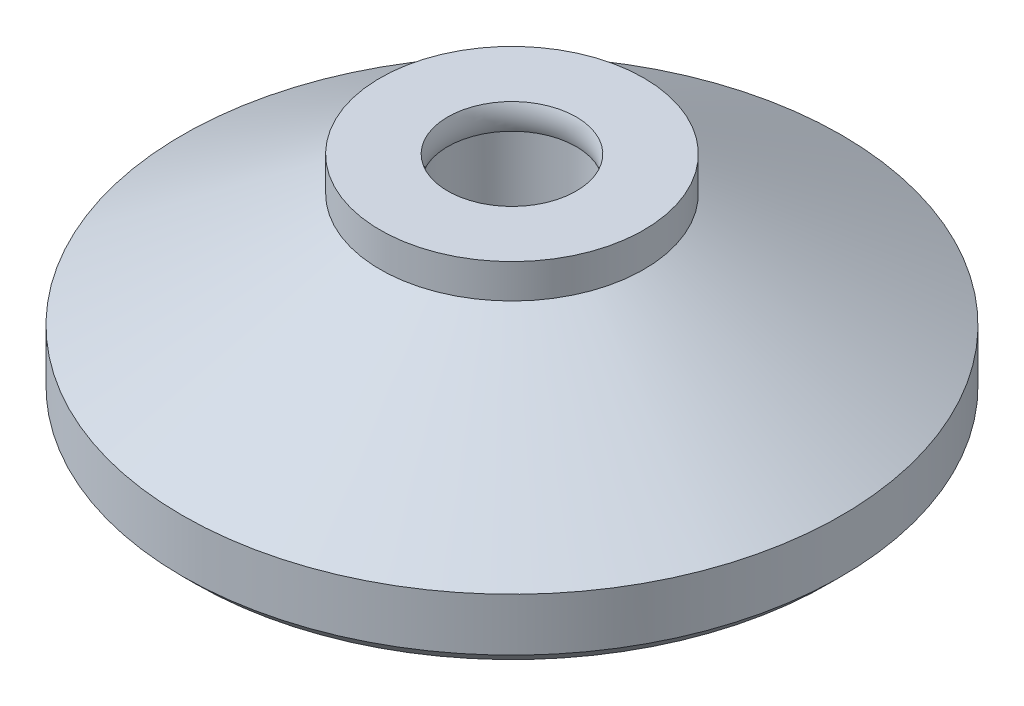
ISO-10303-21;
HEADER;
FILE_DESCRIPTION(('STEP AP214'),'2;1');
FILE_NAME('part.step','',(''),(''),'','','');
FILE_SCHEMA(('AUTOMOTIVE_DESIGN { 1 0 10303 214 1 1 1 1 }'));
ENDSEC;
DATA;
#1=APPLICATION_CONTEXT('core data for automotive mechanical design processes');
#2=APPLICATION_PROTOCOL_DEFINITION('international standard','automotive_design',2000,#1);
#3=PRODUCT_CONTEXT('',#1,'mechanical');
#4=PRODUCT('Part','Part','',(#3));
#5=PRODUCT_RELATED_PRODUCT_CATEGORY('part','',(#4));
#6=PRODUCT_DEFINITION_FORMATION('','',#4);
#7=PRODUCT_DEFINITION_CONTEXT('part definition',#1,'design');
#8=PRODUCT_DEFINITION('design','',#6,#7);
#9=PRODUCT_DEFINITION_SHAPE('','',#8);
#10=(LENGTH_UNIT() NAMED_UNIT(*) SI_UNIT(.MILLI.,.METRE.));
#11=(NAMED_UNIT(*) PLANE_ANGLE_UNIT() SI_UNIT($,.RADIAN.));
#12=(NAMED_UNIT(*) SI_UNIT($,.STERADIAN.) SOLID_ANGLE_UNIT());
#13=UNCERTAINTY_MEASURE_WITH_UNIT(LENGTH_MEASURE(1.E-05),#10,'distance_accuracy_value','');
#14=(GEOMETRIC_REPRESENTATION_CONTEXT(3) GLOBAL_UNCERTAINTY_ASSIGNED_CONTEXT((#13)) GLOBAL_UNIT_ASSIGNED_CONTEXT((#10,
#11,#12)) REPRESENTATION_CONTEXT('',''));
#15=CARTESIAN_POINT('',(0.,0.,0.));
#16=DIRECTION('',(0.,0.,1.));
#17=DIRECTION('',(1.,0.,0.));
#18=AXIS2_PLACEMENT_3D('',#15,#16,#17);
#19=CARTESIAN_POINT('',(0.,6.5,0.));
#20=DIRECTION('',(0.,-1.,0.));
#21=DIRECTION('',(0.,0.,-1.));
#22=AXIS2_PLACEMENT_3D('',#19,#20,#21);
#23=CYLINDRICAL_SURFACE('',#22,8.);
#24=CARTESIAN_POINT('',(0.,4.42820323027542,0.));
#25=DIRECTION('',(0.,1.,0.));
#26=DIRECTION('',(0.,0.,1.));
#27=AXIS2_PLACEMENT_3D('',#24,#25,#26);
#28=CIRCLE('',#27,8.);
#29=CARTESIAN_POINT('',(0.,4.42820323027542,-8.));
#30=VERTEX_POINT('',#29);
#31=EDGE_CURVE('E91',#30,#30,#28,.T.);
#32=CARTESIAN_POINT('',(0.,6.5,0.));
#33=DIRECTION('',(0.,1.,0.));
#34=DIRECTION('',(0.,0.,1.));
#35=AXIS2_PLACEMENT_3D('',#32,#33,#34);
#36=CIRCLE('',#35,8.);
#37=CARTESIAN_POINT('',(0.,6.5,-8.));
#38=VERTEX_POINT('',#37);
#39=EDGE_CURVE('E93',#38,#38,#36,.T.);
#40=CARTESIAN_POINT('',(0.,4.42820323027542,-8.));
#41=CARTESIAN_POINT('',(0.,4.44978444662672,-8.));
#42=CARTESIAN_POINT('',(0.,4.47136566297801,-8.));
#43=CARTESIAN_POINT('',(0.,4.51452809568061,-8.));
#44=CARTESIAN_POINT('',(0.,4.53610931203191,-8.));
#45=CARTESIAN_POINT('',(0.,4.5792717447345,-8.));
#46=CARTESIAN_POINT('',(0.,4.6008529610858,-8.));
#47=CARTESIAN_POINT('',(0.,4.6440153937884,-8.));
#48=CARTESIAN_POINT('',(0.,4.66559661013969,-8.));
#49=CARTESIAN_POINT('',(0.,4.70875904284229,-8.));
#50=CARTESIAN_POINT('',(0.,4.73034025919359,-8.));
#51=CARTESIAN_POINT('',(0.,4.77350269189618,-8.));
#52=CARTESIAN_POINT('',(0.,4.79508390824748,-8.));
#53=CARTESIAN_POINT('',(0.,4.83824634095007,-8.));
#54=CARTESIAN_POINT('',(0.,4.85982755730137,-8.));
#55=CARTESIAN_POINT('',(0.,4.90298999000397,-8.));
#56=CARTESIAN_POINT('',(0.,4.92457120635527,-8.));
#57=CARTESIAN_POINT('',(0.,4.96773363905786,-8.));
#58=CARTESIAN_POINT('',(0.,4.98931485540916,-8.));
#59=CARTESIAN_POINT('',(0.,5.03247728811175,-8.));
#60=CARTESIAN_POINT('',(0.,5.05405850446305,-8.));
#61=CARTESIAN_POINT('',(0.,5.09722093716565,-8.));
#62=CARTESIAN_POINT('',(0.,5.11880215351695,-8.));
#63=CARTESIAN_POINT('',(0.,5.16196458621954,-8.));
#64=CARTESIAN_POINT('',(0.,5.18354580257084,-8.));
#65=CARTESIAN_POINT('',(0.,5.22670823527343,-8.));
#66=CARTESIAN_POINT('',(0.,5.24828945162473,-8.));
#67=CARTESIAN_POINT('',(0.,5.29145188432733,-8.));
#68=CARTESIAN_POINT('',(0.,5.31303310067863,-8.));
#69=CARTESIAN_POINT('',(0.,5.35619553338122,-8.));
#70=CARTESIAN_POINT('',(0.,5.37777674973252,-8.));
#71=CARTESIAN_POINT('',(0.,5.42093918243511,-8.));
#72=CARTESIAN_POINT('',(0.,5.44252039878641,-8.));
#73=CARTESIAN_POINT('',(0.,5.48568283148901,-8.));
#74=CARTESIAN_POINT('',(0.,5.5072640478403,-8.));
#75=CARTESIAN_POINT('',(0.,5.5504264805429,-8.));
#76=CARTESIAN_POINT('',(0.,5.5720076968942,-8.));
#77=CARTESIAN_POINT('',(0.,5.61517012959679,-8.));
#78=CARTESIAN_POINT('',(0.,5.63675134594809,-8.));
#79=CARTESIAN_POINT('',(0.,5.67991377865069,-8.));
#80=CARTESIAN_POINT('',(0.,5.70149499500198,-8.));
#81=CARTESIAN_POINT('',(0.,5.74465742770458,-8.));
#82=CARTESIAN_POINT('',(0.,5.76623864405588,-8.));
#83=CARTESIAN_POINT('',(0.,5.80940107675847,-8.));
#84=CARTESIAN_POINT('',(0.,5.83098229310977,-8.));
#85=CARTESIAN_POINT('',(0.,5.87414472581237,-8.));
#86=CARTESIAN_POINT('',(0.,5.89572594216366,-8.));
#87=CARTESIAN_POINT('',(0.,5.93888837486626,-8.));
#88=CARTESIAN_POINT('',(0.,5.96046959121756,-8.));
#89=CARTESIAN_POINT('',(0.,6.00363202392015,-8.));
#90=CARTESIAN_POINT('',(0.,6.02521324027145,-8.));
#91=CARTESIAN_POINT('',(0.,6.06837567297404,-8.));
#92=CARTESIAN_POINT('',(0.,6.08995688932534,-8.));
#93=CARTESIAN_POINT('',(0.,6.13311932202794,-8.));
#94=CARTESIAN_POINT('',(0.,6.15470053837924,-8.));
#95=CARTESIAN_POINT('',(0.,6.19786297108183,-8.));
#96=CARTESIAN_POINT('',(0.,6.21944418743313,-8.));
#97=CARTESIAN_POINT('',(0.,6.26260662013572,-8.));
#98=CARTESIAN_POINT('',(0.,6.28418783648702,-8.));
#99=CARTESIAN_POINT('',(0.,6.32735026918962,-8.));
#100=CARTESIAN_POINT('',(0.,6.34893148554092,-8.));
#101=CARTESIAN_POINT('',(0.,6.39209391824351,-8.));
#102=CARTESIAN_POINT('',(0.,6.41367513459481,-8.));
#103=CARTESIAN_POINT('',(0.,6.4568375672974,-8.));
#104=CARTESIAN_POINT('',(0.,6.4784187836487,-8.));
#105=CARTESIAN_POINT('',(0.,6.5,-8.));
#106=B_SPLINE_CURVE_WITH_KNOTS('',3,(#40,#41,#42,#43,#44,#45,#46,#47,#48,#49,#50,#51,#52,#53,
#54,#55,#56,#57,#58,#59,#60,#61,#62,#63,#64,#65,#66,#67,#68,#69,#70,#71,#72,#73,#74,#75,#76,#77,
#78,#79,#80,#81,#82,#83,#84,#85,#86,#87,#88,#89,#90,#91,#92,#93,#94,#95,#96,#97,#98,#99,#100,
#101,#102,#103,#104,#105),.UNSPECIFIED.,.F.,.F.,(4,2,2,2,2,2,2,2,2,2,2,2,2,2,2,2,2,2,2,2,2,2,2,
2,2,2,2,2,2,2,2,2,4),(0.,0.064743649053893,0.129487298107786,0.194230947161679,
0.258974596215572,0.323718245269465,0.388461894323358,0.453205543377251,0.517949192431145,
0.582692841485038,0.647436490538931,0.712180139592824,0.776923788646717,0.841667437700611,
0.906411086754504,0.971154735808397,1.03589838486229,1.10064203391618,1.16538568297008,
1.23012933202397,1.29487298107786,1.35961663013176,1.42436027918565,1.48910392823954,
1.55384757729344,1.61859122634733,1.68333487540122,1.74807852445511,1.81282217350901,
1.8775658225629,1.94230947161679,2.00705312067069,2.07179676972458),.UNSPECIFIED.);
#107=EDGE_CURVE('BSEAM37',#30,#38,#106,.T.);
#108=ORIENTED_EDGE('',*,*,#31,.T.);
#109=ORIENTED_EDGE('',*,*,#39,.F.);
#110=ORIENTED_EDGE('',*,*,#107,.T.);
#111=ORIENTED_EDGE('',*,*,#107,.F.);
#112=EDGE_LOOP('',(#108,#110,#109,#111));
#113=FACE_BOUND('',#112,.T.);
#114=ADVANCED_FACE('F37',(#113),#23,.T.);
#115=CARTESIAN_POINT('',(0.,6.5,0.));
#116=DIRECTION('',(0.,1.,0.));
#117=DIRECTION('',(0.,0.,1.));
#118=AXIS2_PLACEMENT_3D('',#115,#116,#117);
#119=PLANE('',#118);
#120=CARTESIAN_POINT('',(0.,6.5,0.));
#121=DIRECTION('',(0.,-1.,0.));
#122=DIRECTION('',(0.,0.,-1.));
#123=AXIS2_PLACEMENT_3D('',#120,#121,#122);
#124=CIRCLE('',#123,3.9);
#125=CARTESIAN_POINT('',(0.,6.5,-3.9));
#126=VERTEX_POINT('',#125);
#127=EDGE_CURVE('E112',#126,#126,#124,.T.);
#128=ORIENTED_EDGE('',*,*,#127,.T.);
#129=EDGE_LOOP('',(#128));
#130=FACE_BOUND('',#129,.T.);
#131=ORIENTED_EDGE('',*,*,#39,.T.);
#132=EDGE_LOOP('',(#131));
#133=FACE_BOUND('',#132,.T.);
#134=ADVANCED_FACE('F65',(#130,#133),#119,.T.);
#135=CARTESIAN_POINT('',(0.,4.42820323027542,0.));
#136=DIRECTION('',(0.,-1.,0.));
#137=DIRECTION('',(0.,0.,-1.));
#138=AXIS2_PLACEMENT_3D('',#135,#136,#137);
#139=CONICAL_SURFACE('',#138,8.,1.0471975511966);
#140=CARTESIAN_POINT('',(0.,-2.5,0.));
#141=DIRECTION('',(0.,1.,0.));
#142=DIRECTION('',(0.,0.,1.));
#143=AXIS2_PLACEMENT_3D('',#140,#141,#142);
#144=CIRCLE('',#143,20.);
#145=CARTESIAN_POINT('',(0.,-2.5,20.));
#146=VERTEX_POINT('',#145);
#147=EDGE_CURVE('E89',#146,#146,#144,.T.);
#148=ORIENTED_EDGE('',*,*,#147,.T.);
#149=EDGE_LOOP('',(#148));
#150=FACE_BOUND('',#149,.T.);
#151=ORIENTED_EDGE('',*,*,#31,.F.);
#152=EDGE_LOOP('',(#151));
#153=FACE_BOUND('',#152,.T.);
#154=ADVANCED_FACE('F70',(#150,#153),#139,.T.);
#155=CARTESIAN_POINT('',(0.,-6.5,0.));
#156=DIRECTION('',(0.,1.,0.));
#157=DIRECTION('',(0.,0.,1.));
#158=AXIS2_PLACEMENT_3D('',#155,#156,#157);
#159=PLANE('',#158);
#160=CARTESIAN_POINT('',(0.,-6.5,0.));
#161=DIRECTION('',(0.,1.,0.));
#162=DIRECTION('',(0.,0.,1.));
#163=AXIS2_PLACEMENT_3D('',#160,#161,#162);
#164=CIRCLE('',#163,19.2);
#165=CARTESIAN_POINT('',(0.,-6.5,19.2));
#166=VERTEX_POINT('',#165);
#167=EDGE_CURVE('E45',#166,#166,#164,.F.);
#168=ORIENTED_EDGE('',*,*,#167,.T.);
#169=EDGE_LOOP('',(#168));
#170=FACE_BOUND('',#169,.T.);
#171=ADVANCED_FACE('F76',(#170),#159,.F.);
#172=CARTESIAN_POINT('',(0.,-2.5,0.));
#173=DIRECTION('',(0.,-1.,0.));
#174=DIRECTION('',(0.,0.,-1.));
#175=AXIS2_PLACEMENT_3D('',#172,#173,#174);
#176=CYLINDRICAL_SURFACE('',#175,20.);
#177=CARTESIAN_POINT('',(0.,-5.69999999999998,0.));
#178=DIRECTION('',(0.,1.,0.));
#179=DIRECTION('',(0.,0.,1.));
#180=AXIS2_PLACEMENT_3D('',#177,#178,#179);
#181=CIRCLE('',#180,20.);
#182=CARTESIAN_POINT('',(0.,-5.69999999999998,20.));
#183=VERTEX_POINT('',#182);
#184=EDGE_CURVE('E11',#183,#183,#181,.T.);
#185=ORIENTED_EDGE('',*,*,#184,.T.);
#186=EDGE_LOOP('',(#185));
#187=FACE_BOUND('',#186,.T.);
#188=ORIENTED_EDGE('',*,*,#147,.F.);
#189=EDGE_LOOP('',(#188));
#190=FACE_BOUND('',#189,.T.);
#191=ADVANCED_FACE('F60',(#187,#190),#176,.T.);
#192=CARTESIAN_POINT('',(0.,-6.5,0.));
#193=DIRECTION('',(0.,1.,0.));
#194=DIRECTION('',(0.,0.,1.));
#195=AXIS2_PLACEMENT_3D('',#192,#193,#194);
#196=CONICAL_SURFACE('',#195,19.2,0.78539816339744);
#197=CARTESIAN_POINT('',(0.,-5.69999999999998,20.));
#198=CARTESIAN_POINT('',(0.,-5.70833333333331,19.9916666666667));
#199=CARTESIAN_POINT('',(0.,-5.71666666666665,19.9833333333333));
#200=CARTESIAN_POINT('',(0.,-5.73333333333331,19.9666666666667));
#201=CARTESIAN_POINT('',(0.,-5.74166666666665,19.9583333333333));
#202=CARTESIAN_POINT('',(0.,-5.75833333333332,19.9416666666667));
#203=CARTESIAN_POINT('',(0.,-5.76666666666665,19.9333333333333));
#204=CARTESIAN_POINT('',(0.,-5.78333333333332,19.9166666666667));
#205=CARTESIAN_POINT('',(0.,-5.79166666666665,19.9083333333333));
#206=CARTESIAN_POINT('',(0.,-5.80833333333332,19.8916666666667));
#207=CARTESIAN_POINT('',(0.,-5.81666666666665,19.8833333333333));
#208=CARTESIAN_POINT('',(0.,-5.83333333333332,19.8666666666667));
#209=CARTESIAN_POINT('',(0.,-5.84166666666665,19.8583333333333));
#210=CARTESIAN_POINT('',(0.,-5.85833333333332,19.8416666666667));
#211=CARTESIAN_POINT('',(0.,-5.86666666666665,19.8333333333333));
#212=CARTESIAN_POINT('',(0.,-5.88333333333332,19.8166666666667));
#213=CARTESIAN_POINT('',(0.,-5.89166666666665,19.8083333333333));
#214=CARTESIAN_POINT('',(0.,-5.90833333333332,19.7916666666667));
#215=CARTESIAN_POINT('',(0.,-5.91666666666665,19.7833333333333));
#216=CARTESIAN_POINT('',(0.,-5.93333333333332,19.7666666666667));
#217=CARTESIAN_POINT('',(0.,-5.94166666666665,19.7583333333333));
#218=CARTESIAN_POINT('',(0.,-5.95833333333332,19.7416666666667));
#219=CARTESIAN_POINT('',(0.,-5.96666666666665,19.7333333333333));
#220=CARTESIAN_POINT('',(0.,-5.98333333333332,19.7166666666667));
#221=CARTESIAN_POINT('',(0.,-5.99166666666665,19.7083333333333));
#222=CARTESIAN_POINT('',(0.,-6.00833333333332,19.6916666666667));
#223=CARTESIAN_POINT('',(0.,-6.01666666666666,19.6833333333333));
#224=CARTESIAN_POINT('',(0.,-6.03333333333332,19.6666666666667));
#225=CARTESIAN_POINT('',(0.,-6.04166666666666,19.6583333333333));
#226=CARTESIAN_POINT('',(0.,-6.05833333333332,19.6416666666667));
#227=CARTESIAN_POINT('',(0.,-6.06666666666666,19.6333333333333));
#228=CARTESIAN_POINT('',(0.,-6.08333333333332,19.6166666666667));
#229=CARTESIAN_POINT('',(0.,-6.09166666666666,19.6083333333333));
#230=CARTESIAN_POINT('',(0.,-6.10833333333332,19.5916666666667));
#231=CARTESIAN_POINT('',(0.,-6.11666666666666,19.5833333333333));
#232=CARTESIAN_POINT('',(0.,-6.13333333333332,19.5666666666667));
#233=CARTESIAN_POINT('',(0.,-6.14166666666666,19.5583333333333));
#234=CARTESIAN_POINT('',(0.,-6.15833333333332,19.5416666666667));
#235=CARTESIAN_POINT('',(0.,-6.16666666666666,19.5333333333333));
#236=CARTESIAN_POINT('',(0.,-6.18333333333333,19.5166666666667));
#237=CARTESIAN_POINT('',(0.,-6.19166666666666,19.5083333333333));
#238=CARTESIAN_POINT('',(0.,-6.20833333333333,19.4916666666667));
#239=CARTESIAN_POINT('',(0.,-6.21666666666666,19.4833333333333));
#240=CARTESIAN_POINT('',(0.,-6.23333333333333,19.4666666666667));
#241=CARTESIAN_POINT('',(0.,-6.24166666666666,19.4583333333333));
#242=CARTESIAN_POINT('',(0.,-6.25833333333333,19.4416666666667));
#243=CARTESIAN_POINT('',(0.,-6.26666666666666,19.4333333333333));
#244=CARTESIAN_POINT('',(0.,-6.28333333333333,19.4166666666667));
#245=CARTESIAN_POINT('',(0.,-6.29166666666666,19.4083333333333));
#246=CARTESIAN_POINT('',(0.,-6.30833333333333,19.3916666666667));
#247=CARTESIAN_POINT('',(0.,-6.31666666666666,19.3833333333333));
#248=CARTESIAN_POINT('',(0.,-6.33333333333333,19.3666666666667));
#249=CARTESIAN_POINT('',(0.,-6.34166666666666,19.3583333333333));
#250=CARTESIAN_POINT('',(0.,-6.35833333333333,19.3416666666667));
#251=CARTESIAN_POINT('',(0.,-6.36666666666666,19.3333333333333));
#252=CARTESIAN_POINT('',(0.,-6.38333333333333,19.3166666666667));
#253=CARTESIAN_POINT('',(0.,-6.39166666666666,19.3083333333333));
#254=CARTESIAN_POINT('',(0.,-6.40833333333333,19.2916666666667));
#255=CARTESIAN_POINT('',(0.,-6.41666666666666,19.2833333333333));
#256=CARTESIAN_POINT('',(0.,-6.43333333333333,19.2666666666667));
#257=CARTESIAN_POINT('',(0.,-6.44166666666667,19.2583333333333));
#258=CARTESIAN_POINT('',(0.,-6.45833333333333,19.2416666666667));
#259=CARTESIAN_POINT('',(0.,-6.46666666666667,19.2333333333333));
#260=CARTESIAN_POINT('',(0.,-6.48333333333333,19.2166666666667));
#261=CARTESIAN_POINT('',(0.,-6.49166666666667,19.2083333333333));
#262=CARTESIAN_POINT('',(0.,-6.5,19.2));
#263=B_SPLINE_CURVE_WITH_KNOTS('',3,(#197,#198,#199,#200,#201,#202,#203,#204,#205,#206,#207,
#208,#209,#210,#211,#212,#213,#214,#215,#216,#217,#218,#219,#220,#221,#222,#223,#224,#225,#226,
#227,#228,#229,#230,#231,#232,#233,#234,#235,#236,#237,#238,#239,#240,#241,#242,#243,#244,#245,
#246,#247,#248,#249,#250,#251,#252,#253,#254,#255,#256,#257,#258,#259,#260,#261,#262),
.UNSPECIFIED.,.F.,.F.,(4,2,2,2,2,2,2,2,2,2,2,2,2,2,2,2,2,2,2,2,2,2,2,2,2,2,2,2,2,2,2,2,4),(0.,
0.0353553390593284,0.0707106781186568,0.106066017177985,0.141421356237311,0.17677669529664,
0.212132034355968,0.247487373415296,0.282842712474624,0.318198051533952,0.353553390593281,
0.388908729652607,0.424264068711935,0.459619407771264,0.494974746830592,0.53033008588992,
0.565685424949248,0.601040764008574,0.636396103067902,0.671751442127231,0.707106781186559,
0.742462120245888,0.777817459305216,0.813172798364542,0.84852813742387,0.883883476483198,
0.919238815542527,0.954594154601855,0.989949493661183,1.02530483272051,1.06066017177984,
1.09601551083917,1.13137084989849),.UNSPECIFIED.);
#264=EDGE_CURVE('BSEAM39',#183,#166,#263,.T.);
#265=ORIENTED_EDGE('',*,*,#184,.F.);
#266=ORIENTED_EDGE('',*,*,#167,.F.);
#267=ORIENTED_EDGE('',*,*,#264,.T.);
#268=ORIENTED_EDGE('',*,*,#264,.F.);
#269=EDGE_LOOP('',(#265,#267,#266,#268));
#270=FACE_BOUND('',#269,.T.);
#271=ADVANCED_FACE('F39',(#270),#196,.T.);
#272=CARTESIAN_POINT('',(0.,-2.5,0.));
#273=DIRECTION('',(0.,1.,0.));
#274=DIRECTION('',(0.,0.,1.));
#275=AXIS2_PLACEMENT_3D('',#272,#273,#274);
#276=CONICAL_SURFACE('',#275,0.,1.04719755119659);
#277=CARTESIAN_POINT('',(0.,-0.248333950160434,0.));
#278=DIRECTION('',(0.,-1.,0.));
#279=DIRECTION('',(0.,0.,-1.));
#280=AXIS2_PLACEMENT_3D('',#277,#278,#279);
#281=CIRCLE('',#280,3.9);
#282=CARTESIAN_POINT('',(0.,-0.248333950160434,-3.9));
#283=VERTEX_POINT('',#282);
#284=EDGE_CURVE('E100',#283,#283,#281,.T.);
#285=ORIENTED_EDGE('',*,*,#284,.F.);
#286=EDGE_LOOP('',(#285));
#287=FACE_BOUND('',#286,.T.);
#288=CARTESIAN_POINT('',(0.,-2.5,0.));
#289=VERTEX_POINT('',#288);
#290=VERTEX_LOOP('',#289);
#291=FACE_BOUND('',#290,.T.);
#292=ADVANCED_FACE('F48',(#287,#291),#276,.F.);
#293=CARTESIAN_POINT('',(0.,0.,0.));
#294=DIRECTION('',(0.,-1.,0.));
#295=DIRECTION('',(0.,0.,-1.));
#296=AXIS2_PLACEMENT_3D('',#293,#294,#295);
#297=CYLINDRICAL_SURFACE('',#296,3.9);
#298=CARTESIAN_POINT('',(0.,4.94,0.));
#299=DIRECTION('',(0.,-1.,0.));
#300=DIRECTION('',(0.,0.,-1.));
#301=AXIS2_PLACEMENT_3D('',#298,#299,#300);
#302=CIRCLE('',#301,3.9);
#303=CARTESIAN_POINT('',(0.,4.94,-3.9));
#304=VERTEX_POINT('',#303);
#305=EDGE_CURVE('E110',#304,#304,#302,.T.);
#306=ORIENTED_EDGE('',*,*,#305,.F.);
#307=EDGE_LOOP('',(#306));
#308=FACE_BOUND('',#307,.T.);
#309=ORIENTED_EDGE('',*,*,#284,.T.);
#310=EDGE_LOOP('',(#309));
#311=FACE_BOUND('',#310,.T.);
#312=ADVANCED_FACE('F50',(#308,#311),#297,.F.);
#313=CARTESIAN_POINT('',(0.,5.72,0.));
#314=DIRECTION('',(0.,-1.,0.));
#315=DIRECTION('',(0.,0.,-1.));
#316=AXIS2_PLACEMENT_3D('',#313,#314,#315);
#317=TOROIDAL_SURFACE('',#316,5.77200000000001,2.02800000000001);
#318=ORIENTED_EDGE('',*,*,#127,.F.);
#319=EDGE_LOOP('',(#318));
#320=FACE_BOUND('',#319,.T.);
#321=ORIENTED_EDGE('',*,*,#305,.T.);
#322=EDGE_LOOP('',(#321));
#323=FACE_BOUND('',#322,.T.);
#324=ADVANCED_FACE('F57',(#320,#323),#317,.T.);
#325=CLOSED_SHELL('',(#114,#134,#154,#171,#191,#271,#292,#312,#324));
#326=MANIFOLD_SOLID_BREP('B2',#325);
#327=ADVANCED_BREP_SHAPE_REPRESENTATION('',(#18,#326),#14);
#328=SHAPE_DEFINITION_REPRESENTATION(#9,#327);
ENDSEC;
END-ISO-10303-21;
